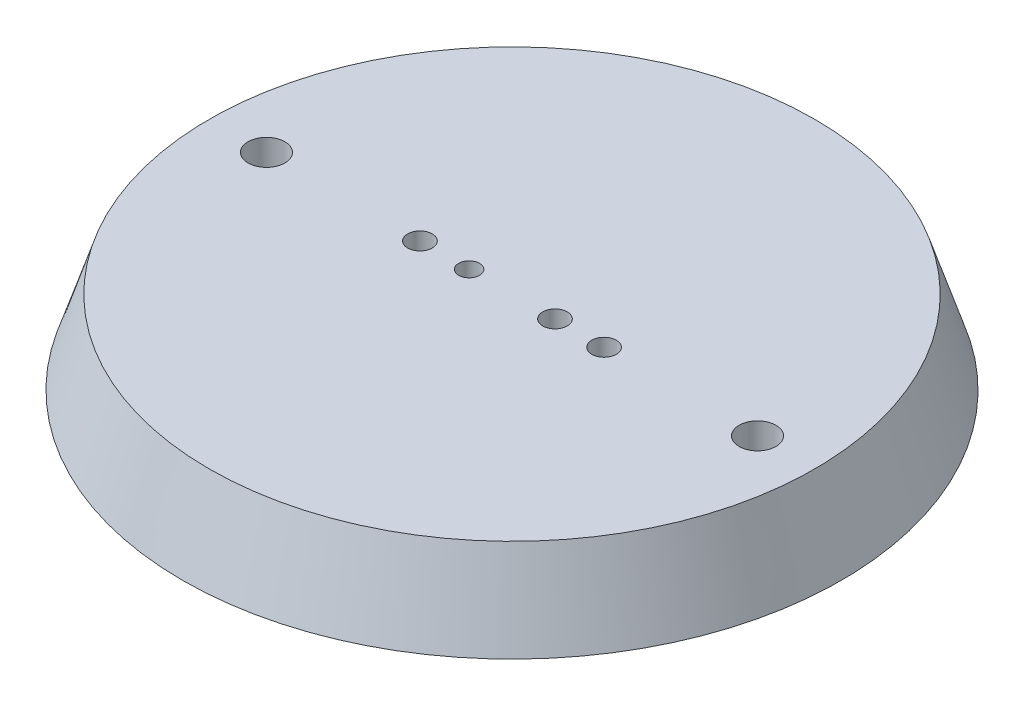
from build123d import *

# Parameters (mm, degrees)
SKETCH6_R          = 2
CUT_EXTRUDE3_DEPTH = 78.127006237
SKETCH8_R          = 2
CUT_EXTRUDE4_DEPTH = 77.538766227
SKETCH10_R         = 3
CUT_EXTRUDE5_DEPTH = 78.127006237
SKETCH12_R         = 3
CUT_EXTRUDE6_DEPTH = 78.127006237
SKETCH3_R          = 1.69953876
CUT_EXTRUDE1_DEPTH = 78.127006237
SKETCH4_R          = 2
CUT_EXTRUDE2_DEPTH = 78.127006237


with BuildPart() as part:
    # Sketch1 → Revolve1 (revolve)
    with BuildSketch(Plane(origin=(0, 0, 0), x_dir=(0, 0, -1), z_dir=(1, 0, 0)), mode=Mode.PRIVATE) as revolve1_sk:
        Polygon((53.69039039, -4.818368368), (30.492180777, -4.818368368), (30.492180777, 4.818368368), (0, 4.818368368), (0, 8.718952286), (49.330914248, 8.718952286), align=None)
    revolve(revolve1_sk.sketch.rotate(Axis((0, 45.43033033, 0), (0, -1, 0)), 180), axis=Axis((0, 45.43033033, 0), (0, -1, 0)))

    # Sketch6 → Cut-Extrude3 (cut, through all)
    with BuildSketch(Plane(origin=(0, 8.718952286, 0), x_dir=(-1, 0, 0), z_dir=(0, 1, 0))):
        with Locations(Location((15, 0, 0), (0, 0, 90))):
            Circle(SKETCH6_R)
    extrude(amount=-CUT_EXTRUDE3_DEPTH, mode=Mode.SUBTRACT)

    # Sketch8 → Cut-Extrude4 (cut, through all)
    with BuildSketch(Plane.XZ.offset(-4.818368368)):
        with Locations(Location((15, 0, 0), (0, 0, 270))):
            Circle(SKETCH8_R)
    extrude(amount=-CUT_EXTRUDE4_DEPTH, mode=Mode.SUBTRACT)

    # Sketch10 → Cut-Extrude5 (cut, through all)
    with BuildSketch(Plane.XZ.offset(4.818368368)):
        with Locations(Location((-40, 0, 0), (0, 0, 270))):
            Circle(SKETCH10_R)
    extrude(amount=-CUT_EXTRUDE5_DEPTH, mode=Mode.SUBTRACT)

    # Sketch12 → Cut-Extrude6 (cut, through all)
    with BuildSketch(Plane.XZ.offset(4.818368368)):
        with Locations(Location((40, 0, 0), (0, 0, 270))):
            Circle(SKETCH12_R)
    extrude(amount=-CUT_EXTRUDE6_DEPTH, mode=Mode.SUBTRACT)

    # Sketch3 → Cut-Extrude1 (cut, through all)
    with BuildSketch(Plane(origin=(0, 8.718952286, 0), x_dir=(-1, 0, 0), z_dir=(0, 1, 0))):
        with Locations(Location((6.986737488, 0, 0), (0, 0, 90))):
            Circle(SKETCH3_R)
    extrude(amount=-CUT_EXTRUDE1_DEPTH, mode=Mode.SUBTRACT)

    # Sketch4 → Cut-Extrude2 (cut, through all)
    with BuildSketch(Plane(origin=(0, 8.718952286, 0), x_dir=(-1, 0, 0), z_dir=(0, 1, 0))):
        with Locations(Location((-7, 0, 0), (0, 0, 90))):
            Circle(SKETCH4_R)
    extrude(amount=-CUT_EXTRUDE2_DEPTH, mode=Mode.SUBTRACT)


solid = part.part
